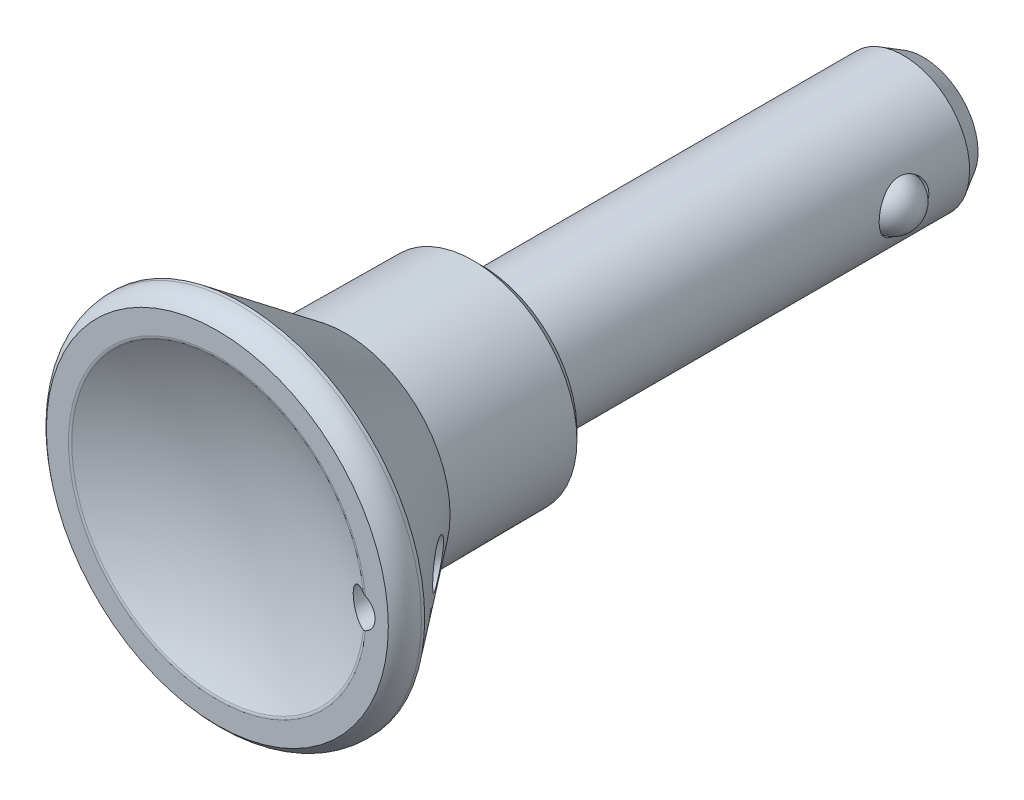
ISO-10303-21;
HEADER;
FILE_DESCRIPTION(('STEP AP214'),'2;1');
FILE_NAME('part.step','',(''),(''),'','','');
FILE_SCHEMA(('AUTOMOTIVE_DESIGN { 1 0 10303 214 1 1 1 1 }'));
ENDSEC;
DATA;
#1=APPLICATION_CONTEXT('core data for automotive mechanical design processes');
#2=APPLICATION_PROTOCOL_DEFINITION('international standard','automotive_design',2000,#1);
#3=PRODUCT_CONTEXT('',#1,'mechanical');
#4=PRODUCT('Part','Part','',(#3));
#5=PRODUCT_RELATED_PRODUCT_CATEGORY('part','',(#4));
#6=PRODUCT_DEFINITION_FORMATION('','',#4);
#7=PRODUCT_DEFINITION_CONTEXT('part definition',#1,'design');
#8=PRODUCT_DEFINITION('design','',#6,#7);
#9=PRODUCT_DEFINITION_SHAPE('','',#8);
#10=(LENGTH_UNIT() NAMED_UNIT(*) SI_UNIT(.MILLI.,.METRE.));
#11=(NAMED_UNIT(*) PLANE_ANGLE_UNIT() SI_UNIT($,.RADIAN.));
#12=(NAMED_UNIT(*) SI_UNIT($,.STERADIAN.) SOLID_ANGLE_UNIT());
#13=UNCERTAINTY_MEASURE_WITH_UNIT(LENGTH_MEASURE(1.E-05),#10,'distance_accuracy_value','');
#14=(GEOMETRIC_REPRESENTATION_CONTEXT(3) GLOBAL_UNCERTAINTY_ASSIGNED_CONTEXT((#13)) GLOBAL_UNIT_ASSIGNED_CONTEXT((#10,
#11,#12)) REPRESENTATION_CONTEXT('',''));
#15=CARTESIAN_POINT('',(0.,0.,0.));
#16=DIRECTION('',(0.,0.,1.));
#17=DIRECTION('',(1.,0.,0.));
#18=AXIS2_PLACEMENT_3D('',#15,#16,#17);
#19=CARTESIAN_POINT('',(0.,0.,23.5));
#20=DIRECTION('',(0.,0.,1.));
#21=DIRECTION('',(0.,-1.,0.));
#22=AXIS2_PLACEMENT_3D('',#19,#20,#21);
#23=TOROIDAL_SURFACE('',#22,13.499629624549,0.50000000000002);
#24=CARTESIAN_POINT('',(13.1832697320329,1.45020836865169,23.940350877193));
#25=CARTESIAN_POINT('',(13.1967898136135,1.44663630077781,23.9473693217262));
#26=CARTESIAN_POINT('',(13.2105528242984,1.44279517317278,23.9537540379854));
#27=CARTESIAN_POINT('',(13.2384329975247,1.43456873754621,23.9652617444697));
#28=CARTESIAN_POINT('',(13.2525500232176,1.43018363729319,23.9703852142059));
#29=CARTESIAN_POINT('',(13.294658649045,1.41639274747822,23.9836925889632));
#30=CARTESIAN_POINT('',(13.322980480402,1.40620303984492,23.9901034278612));
#31=CARTESIAN_POINT('',(13.3645007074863,1.38980064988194,23.9961744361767));
#32=CARTESIAN_POINT('',(13.377775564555,1.38433480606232,23.9976116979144));
#33=CARTESIAN_POINT('',(13.4043485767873,1.37294329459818,23.9995283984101));
#34=CARTESIAN_POINT('',(13.4176457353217,1.3670137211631,23.999998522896));
#35=CARTESIAN_POINT('',(13.430859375,1.3608881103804,24.));
#36=B_SPLINE_CURVE_WITH_KNOTS('',3,(#24,#25,#26,#27,#28,#29,#30,#31,#32,#33,#34,#35),
.UNSPECIFIED.,.F.,.F.,(4,2,2,2,2,4),(0.,0.046898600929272,0.0937793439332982,0.185591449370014,
0.228845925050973,0.272515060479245),.UNSPECIFIED.);
#37=CARTESIAN_POINT('',(13.1832697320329,1.45020836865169,23.940350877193));
#38=VERTEX_POINT('',#37);
#39=CARTESIAN_POINT('',(13.430859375,1.36088811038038,24.));
#40=VERTEX_POINT('',#39);
#41=EDGE_CURVE('E60',#38,#40,#36,.T.);
#42=ORIENTED_EDGE('',*,*,#41,.T.);
#43=CARTESIAN_POINT('',(0.,0.,24.));
#44=DIRECTION('',(0.,0.,1.));
#45=DIRECTION('',(0.,-1.,0.));
#46=AXIS2_PLACEMENT_3D('',#43,#44,#45);
#47=CIRCLE('',#46,13.499629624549);
#48=CARTESIAN_POINT('',(13.430859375,-1.36088811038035,24.));
#49=VERTEX_POINT('',#48);
#50=EDGE_CURVE('E39',#49,#40,#47,.F.);
#51=ORIENTED_EDGE('',*,*,#50,.F.);
#52=CARTESIAN_POINT('',(13.430859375,-1.36088811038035,24.));
#53=CARTESIAN_POINT('',(13.4166665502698,-1.36746807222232,23.9999984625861));
#54=CARTESIAN_POINT('',(13.4023759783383,-1.37382175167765,23.9994558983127));
#55=CARTESIAN_POINT('',(13.3736641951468,-1.38605678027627,23.9972288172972));
#56=CARTESIAN_POINT('',(13.3592428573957,-1.39193760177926,23.9955430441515));
#57=CARTESIAN_POINT('',(13.316571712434,-1.4085689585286,23.9887845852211));
#58=CARTESIAN_POINT('',(13.2882736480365,-1.41860415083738,23.9820148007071));
#59=CARTESIAN_POINT('',(13.2473798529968,-1.43179699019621,23.9685266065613));
#60=CARTESIAN_POINT('',(13.2344037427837,-1.43578270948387,23.9636790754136));
#61=CARTESIAN_POINT('',(13.2086362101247,-1.44332889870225,23.9528611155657));
#62=CARTESIAN_POINT('',(13.1958479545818,-1.44688469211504,23.9468798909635));
#63=CARTESIAN_POINT('',(13.1832697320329,-1.45020836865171,23.940350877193));
#64=B_SPLINE_CURVE_WITH_KNOTS('',3,(#52,#53,#54,#55,#56,#57,#58,#59,#60,#61,#62,#63),
.UNSPECIFIED.,.F.,.F.,(4,2,2,2,2,4),(0.,0.0469051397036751,0.0938619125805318,0.185680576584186,
0.228880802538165,0.272515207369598),.UNSPECIFIED.);
#65=CARTESIAN_POINT('',(13.1832697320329,-1.4502083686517,23.940350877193));
#66=VERTEX_POINT('',#65);
#67=EDGE_CURVE('E20',#49,#66,#64,.T.);
#68=ORIENTED_EDGE('',*,*,#67,.T.);
#69=CARTESIAN_POINT('',(0.,0.,23.940350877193));
#70=DIRECTION('',(0.,0.,1.));
#71=DIRECTION('',(0.,-1.,0.));
#72=AXIS2_PLACEMENT_3D('',#69,#70,#71);
#73=CIRCLE('',#72,13.2627940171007);
#74=EDGE_CURVE('E54',#38,#66,#73,.T.);
#75=ORIENTED_EDGE('',*,*,#74,.F.);
#76=EDGE_LOOP('',(#42,#51,#68,#75));
#77=FACE_BOUND('',#76,.T.);
#78=ADVANCED_FACE('F15',(#77),#23,.T.);
#79=CARTESIAN_POINT('',(0.,0.,48.6));
#80=DIRECTION('',(0.,-1.,0.));
#81=DIRECTION('',(0.,0.,1.));
#82=AXIS2_PLACEMENT_3D('',#79,#80,#81);
#83=SPHERICAL_SURFACE('',#82,28.);
#84=CARTESIAN_POINT('',(13.1832697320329,1.45020836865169,23.940350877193));
#85=CARTESIAN_POINT('',(13.0915993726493,1.4744532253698,23.8927620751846));
#86=CARTESIAN_POINT('',(12.9980560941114,1.489860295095,23.8443501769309));
#87=CARTESIAN_POINT('',(12.8097591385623,1.50293318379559,23.7471842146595));
#88=CARTESIAN_POINT('',(12.7150040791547,1.50057651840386,23.6984297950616));
#89=CARTESIAN_POINT('',(12.5270201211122,1.47798913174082,23.6019874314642));
#90=CARTESIAN_POINT('',(12.4337919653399,1.45774995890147,23.5543000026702));
#91=CARTESIAN_POINT('',(12.2517517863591,1.39948117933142,23.4614379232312));
#92=CARTESIAN_POINT('',(12.1629377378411,1.36145981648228,23.416262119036));
#93=CARTESIAN_POINT('',(11.9952411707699,1.26934990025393,23.3311736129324));
#94=CARTESIAN_POINT('',(11.9161458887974,1.21575714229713,23.2911465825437));
#95=CARTESIAN_POINT('',(11.7681643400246,1.09295087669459,23.2164149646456));
#96=CARTESIAN_POINT('',(11.6992729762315,1.02374521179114,23.1817077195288));
#97=CARTESIAN_POINT('',(11.5811025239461,0.878735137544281,23.1222729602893));
#98=CARTESIAN_POINT('',(11.5305709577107,0.804216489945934,23.0969048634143));
#99=CARTESIAN_POINT('',(11.4431131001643,0.645771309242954,23.0530473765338));
#100=CARTESIAN_POINT('',(11.4061726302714,0.561854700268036,23.0345508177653));
#101=CARTESIAN_POINT('',(11.3518094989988,0.398913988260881,23.0073479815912));
#102=CARTESIAN_POINT('',(11.332464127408,0.320688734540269,22.9976766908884));
#103=CARTESIAN_POINT('',(11.3065630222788,0.161638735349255,22.9847305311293));
#104=CARTESIAN_POINT('',(11.3000015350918,0.0808151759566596,22.9814527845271));
#105=CARTESIAN_POINT('',(11.2999985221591,-0.0778011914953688,22.9814513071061));
#106=CARTESIAN_POINT('',(11.3060768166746,-0.155594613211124,22.9844877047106));
#107=CARTESIAN_POINT('',(11.3300927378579,-0.308850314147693,22.9964912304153));
#108=CARTESIAN_POINT('',(11.3480306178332,-0.384312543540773,23.0054584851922));
#109=CARTESIAN_POINT('',(11.3948947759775,-0.530632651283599,23.0289063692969));
#110=CARTESIAN_POINT('',(11.4237977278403,-0.601499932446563,23.0433752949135));
#111=CARTESIAN_POINT('',(11.4913996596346,-0.737094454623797,23.0772561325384));
#112=CARTESIAN_POINT('',(11.5301003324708,-0.801820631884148,23.0966688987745));
#113=CARTESIAN_POINT('',(11.6176766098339,-0.926360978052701,23.1406602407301));
#114=CARTESIAN_POINT('',(11.6669073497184,-0.98586052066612,23.1654195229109));
#115=CARTESIAN_POINT('',(11.7728262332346,-1.09578522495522,23.2187793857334));
#116=CARTESIAN_POINT('',(11.8295165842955,-1.14620769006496,23.2473811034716));
#117=CARTESIAN_POINT('',(11.9547131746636,-1.24189507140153,23.3106654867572));
#118=CARTESIAN_POINT('',(12.0238340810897,-1.28614058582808,23.3456702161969));
#119=CARTESIAN_POINT('',(12.1672246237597,-1.36242212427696,23.4184517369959));
#120=CARTESIAN_POINT('',(12.2414976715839,-1.39444996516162,23.4562303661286));
#121=CARTESIAN_POINT('',(12.3592920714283,-1.4344825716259,23.5162885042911));
#122=CARTESIAN_POINT('',(12.4017101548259,-1.44682505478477,23.5379430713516));
#123=CARTESIAN_POINT('',(12.4872184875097,-1.46768648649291,23.5816530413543));
#124=CARTESIAN_POINT('',(12.5303081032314,-1.47620883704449,23.603708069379));
#125=CARTESIAN_POINT('',(12.6602504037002,-1.49604024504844,23.6703078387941));
#126=CARTESIAN_POINT('',(12.7478240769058,-1.50162964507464,23.7153114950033));
#127=CARTESIAN_POINT('',(12.8938293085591,-1.49821627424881,23.7905484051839));
#128=CARTESIAN_POINT('',(12.9524047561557,-1.49339577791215,23.8207882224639));
#129=CARTESIAN_POINT('',(13.0686394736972,-1.47691090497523,23.8809033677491));
#130=CARTESIAN_POINT('',(13.1263001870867,-1.46525870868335,23.9107792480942));
#131=CARTESIAN_POINT('',(13.1832697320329,-1.4502083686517,23.9403508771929));
#132=B_SPLINE_CURVE_WITH_KNOTS('',3,(#84,#85,#86,#87,#88,#89,#90,#91,#92,#93,#94,#95,#96,#97,
#98,#99,#100,#101,#102,#103,#104,#105,#106,#107,#108,#109,#110,#111,#112,#113,#114,#115,#116,
#117,#118,#119,#120,#121,#122,#123,#124,#125,#126,#127,#128,#129,#130,#131),.UNSPECIFIED.,.F.,
.F.,(4,2,2,2,2,2,2,2,2,2,2,2,2,2,2,2,2,2,2,2,2,2,2,4),(0.,0.317865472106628,0.636133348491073,
0.954551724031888,1.27282262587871,1.58190076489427,1.89082399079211,2.16986616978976,
2.44861641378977,2.69085568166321,2.93298589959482,3.16608592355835,3.39919092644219,
3.63180279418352,3.8644548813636,4.10674626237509,4.34910950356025,4.61569988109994,
4.88246850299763,5.02992533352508,5.17725058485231,5.4717357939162,5.66970066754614,
5.86731365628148),.UNSPECIFIED.);
#133=EDGE_CURVE('E50',#38,#66,#132,.T.);
#134=ORIENTED_EDGE('',*,*,#133,.F.);
#135=ORIENTED_EDGE('',*,*,#74,.T.);
#136=EDGE_LOOP('',(#134,#135));
#137=FACE_BOUND('',#136,.T.);
#138=ADVANCED_FACE('F52',(#137),#83,.F.);
#139=CARTESIAN_POINT('',(-15.81,-15.5,24.));
#140=CARTESIAN_POINT('',(-15.5,-15.5,24.));
#141=CARTESIAN_POINT('',(15.5,-15.5,24.));
#142=B_SPLINE_CURVE_WITH_KNOTS('',1,(#139,#140,#141),.UNSPECIFIED.,.F.,.F.,(2,1,2),(-0.01,0.,
1.),.UNSPECIFIED.);
#143=DIRECTION('',(0.,1.,0.));
#144=VECTOR('',#143,1.);
#145=SURFACE_OF_LINEAR_EXTRUSION('',#142,#144);
#146=CARTESIAN_POINT('',(12.8,0.,24.));
#147=DIRECTION('',(0.,0.,1.));
#148=DIRECTION('',(0.,-1.,0.));
#149=AXIS2_PLACEMENT_3D('',#146,#147,#148);
#150=CIRCLE('',#149,1.5);
#151=EDGE_CURVE('E57',#49,#40,#150,.T.);
#152=ORIENTED_EDGE('',*,*,#151,.F.);
#153=ORIENTED_EDGE('',*,*,#50,.T.);
#154=EDGE_LOOP('',(#152,#153));
#155=FACE_BOUND('',#154,.T.);
#156=CARTESIAN_POINT('',(0.,0.,24.));
#157=DIRECTION('',(0.,0.,1.));
#158=DIRECTION('',(0.,-1.,0.));
#159=AXIS2_PLACEMENT_3D('',#156,#157,#158);
#160=CIRCLE('',#159,15.5);
#161=CARTESIAN_POINT('',(0.,-15.5,24.));
#162=VERTEX_POINT('',#161);
#163=EDGE_CURVE('E58',#162,#162,#160,.F.);
#164=ORIENTED_EDGE('',*,*,#163,.F.);
#165=EDGE_LOOP('',(#164));
#166=FACE_BOUND('',#165,.T.);
#167=ADVANCED_FACE('F156',(#155,#166),#145,.T.);
#168=CARTESIAN_POINT('',(0.,0.,22.));
#169=DIRECTION('',(0.,0.,1.));
#170=DIRECTION('',(0.,-1.,0.));
#171=AXIS2_PLACEMENT_3D('',#168,#169,#170);
#172=TOROIDAL_SURFACE('',#171,14.,2.5);
#173=ORIENTED_EDGE('',*,*,#163,.T.);
#174=EDGE_LOOP('',(#173));
#175=FACE_BOUND('',#174,.T.);
#176=CARTESIAN_POINT('',(0.,0.,22.));
#177=DIRECTION('',(0.,0.,1.));
#178=DIRECTION('',(1.,0.,0.));
#179=AXIS2_PLACEMENT_3D('',#176,#177,#178);
#180=CIRCLE('',#179,16.5);
#181=CARTESIAN_POINT('',(16.5,0.,22.));
#182=VERTEX_POINT('',#181);
#183=EDGE_CURVE('E101',#182,#182,#180,.F.);
#184=ORIENTED_EDGE('',*,*,#183,.F.);
#185=EDGE_LOOP('',(#184));
#186=FACE_BOUND('',#185,.T.);
#187=ADVANCED_FACE('F79',(#175,#186),#172,.T.);
#188=CARTESIAN_POINT('',(12.8,0.,14.7910576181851));
#189=DIRECTION('',(0.,0.,1.));
#190=DIRECTION('',(0.,-1.,0.));
#191=AXIS2_PLACEMENT_3D('',#188,#189,#190);
#192=CYLINDRICAL_SURFACE('',#191,1.5);
#193=CARTESIAN_POINT('',(12.62421875,-1.48966471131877,16.6671130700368));
#194=CARTESIAN_POINT('',(12.6920032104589,-1.49766166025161,16.7577945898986));
#195=CARTESIAN_POINT('',(12.7603283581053,-1.50104579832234,16.8484671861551));
#196=CARTESIAN_POINT('',(12.897645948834,-1.49839397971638,17.0292601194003));
#197=CARTESIAN_POINT('',(12.9666387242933,-1.49235306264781,17.1193801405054));
#198=CARTESIAN_POINT('',(13.1046564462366,-1.47039580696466,17.2982798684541));
#199=CARTESIAN_POINT('',(13.1736813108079,-1.45448817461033,17.3870606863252));
#200=CARTESIAN_POINT('',(13.3110827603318,-1.41207641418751,17.5624849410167));
#201=CARTESIAN_POINT('',(13.3794598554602,-1.38558148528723,17.6491301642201));
#202=CARTESIAN_POINT('',(13.5187485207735,-1.31898430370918,17.8243946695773));
#203=CARTESIAN_POINT('',(13.5895656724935,-1.27816038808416,17.9128199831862));
#204=CARTESIAN_POINT('',(13.7277317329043,-1.18169522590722,18.084148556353));
#205=CARTESIAN_POINT('',(13.7950853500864,-1.12607476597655,18.1670593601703));
#206=CARTESIAN_POINT('',(13.9084086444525,-1.01303116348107,18.3057043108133));
#207=CARTESIAN_POINT('',(13.9556726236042,-0.959133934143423,18.3632332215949));
#208=CARTESIAN_POINT('',(14.0446143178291,-0.840483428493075,18.471045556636));
#209=CARTESIAN_POINT('',(14.0863013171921,-0.77574860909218,18.5213410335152));
#210=CARTESIAN_POINT('',(14.1507925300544,-0.654717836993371,18.5988956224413));
#211=CARTESIAN_POINT('',(14.1756178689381,-0.601120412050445,18.6286642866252));
#212=CARTESIAN_POINT('',(14.2195452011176,-0.488403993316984,18.6812412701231));
#213=CARTESIAN_POINT('',(14.238652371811,-0.429290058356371,18.7040558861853));
#214=CARTESIAN_POINT('',(14.2689681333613,-0.309460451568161,18.7402118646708));
#215=CARTESIAN_POINT('',(14.2805052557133,-0.248950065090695,18.7539474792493));
#216=CARTESIAN_POINT('',(14.2960184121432,-0.12562551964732,18.77240966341));
#217=CARTESIAN_POINT('',(14.3000000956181,-0.0628131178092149,18.7771429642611));
#218=CARTESIAN_POINT('',(14.2999999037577,0.0632231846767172,18.7771427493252));
#219=CARTESIAN_POINT('',(14.2959658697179,0.126447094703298,18.7723472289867));
#220=CARTESIAN_POINT('',(14.2802519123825,0.250551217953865,18.7536458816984));
#221=CARTESIAN_POINT('',(14.2685662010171,0.311429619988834,18.7397331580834));
#222=CARTESIAN_POINT('',(14.2387365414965,0.428564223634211,18.7041556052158));
#223=CARTESIAN_POINT('',(14.2206451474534,0.484853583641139,18.6825538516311));
#224=CARTESIAN_POINT('',(14.1792492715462,0.592453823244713,18.633014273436));
#225=CARTESIAN_POINT('',(14.1559422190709,0.643762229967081,18.6050733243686));
#226=CARTESIAN_POINT('',(14.0931329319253,0.764461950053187,18.5295741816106));
#227=CARTESIAN_POINT('',(14.0512237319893,0.830727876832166,18.4790335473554));
#228=CARTESIAN_POINT('',(13.9615408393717,0.952125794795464,18.370367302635));
#229=CARTESIAN_POINT('',(13.9137529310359,1.00722990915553,18.3122232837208));
#230=CARTESIAN_POINT('',(13.7883270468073,1.13348006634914,18.1588182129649));
#231=CARTESIAN_POINT('',(13.708179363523,1.1978805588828,18.0600849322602));
#232=CARTESIAN_POINT('',(13.5435609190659,1.3064664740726,17.8554996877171));
#233=CARTESIAN_POINT('',(13.4590828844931,1.35061655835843,17.7496356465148));
#234=CARTESIAN_POINT('',(13.3107013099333,1.41202717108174,17.5619635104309));
#235=CARTESIAN_POINT('',(13.2471965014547,1.43330058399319,17.4811068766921));
#236=CARTESIAN_POINT('',(13.1198264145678,1.46698834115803,17.3177942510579));
#237=CARTESIAN_POINT('',(13.0559609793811,1.47939847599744,17.2353375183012));
#238=CARTESIAN_POINT('',(12.9282718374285,1.49589397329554,17.0692879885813));
#239=CARTESIAN_POINT('',(12.8644485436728,1.49996064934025,16.9856930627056));
#240=CARTESIAN_POINT('',(12.7374091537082,1.5000387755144,16.8180712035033));
#241=CARTESIAN_POINT('',(12.6741929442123,1.49605175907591,16.7340443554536));
#242=CARTESIAN_POINT('',(12.5469978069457,1.47993658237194,16.5637117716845));
#243=CARTESIAN_POINT('',(12.4830456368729,1.46758777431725,16.4774068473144));
#244=CARTESIAN_POINT('',(12.3565302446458,1.43443826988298,16.3053467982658));
#245=CARTESIAN_POINT('',(12.2939675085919,1.41363466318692,16.2195918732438));
#246=CARTESIAN_POINT('',(12.1709555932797,1.36334219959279,16.0496685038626));
#247=CARTESIAN_POINT('',(12.1104987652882,1.33388949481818,15.9654949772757));
#248=CARTESIAN_POINT('',(11.9920388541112,1.26565016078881,15.7992974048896));
#249=CARTESIAN_POINT('',(11.9340336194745,1.2268719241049,15.7172714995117));
#250=CARTESIAN_POINT('',(11.8266654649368,1.14315320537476,15.5643050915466));
#251=CARTESIAN_POINT('',(11.7770073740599,1.09916121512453,15.4930561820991));
#252=CARTESIAN_POINT('',(11.6811267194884,1.0014126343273,15.3545942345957));
#253=CARTESIAN_POINT('',(11.6349116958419,0.947635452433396,15.2873901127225));
#254=CARTESIAN_POINT('',(11.5691423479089,0.858125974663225,15.1911821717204));
#255=CARTESIAN_POINT('',(11.5476572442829,0.826531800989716,15.1596504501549));
#256=CARTESIAN_POINT('',(11.5063433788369,0.760253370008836,15.0988444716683));
#257=CARTESIAN_POINT('',(11.4865152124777,0.725568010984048,15.0695710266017));
#258=CARTESIAN_POINT('',(11.4302732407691,0.616814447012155,14.9863165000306));
#259=CARTESIAN_POINT('',(11.3967954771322,0.537651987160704,14.9364517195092));
#260=CARTESIAN_POINT('',(11.3555291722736,0.407099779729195,14.8747804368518));
#261=CARTESIAN_POINT('',(11.3430899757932,0.360365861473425,14.856144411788));
#262=CARTESIAN_POINT('',(11.3225831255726,0.263914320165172,14.8253840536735));
#263=CARTESIAN_POINT('',(11.3145046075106,0.214204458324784,14.8132435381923));
#264=CARTESIAN_POINT('',(11.3059949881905,0.136701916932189,14.8004485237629));
#265=CARTESIAN_POINT('',(11.3037543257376,0.109528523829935,14.7970776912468));
#266=CARTESIAN_POINT('',(11.300755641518,0.0549082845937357,14.7925658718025));
#267=CARTESIAN_POINT('',(11.2999979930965,0.0274613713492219,14.791425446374));
#268=CARTESIAN_POINT('',(11.3000036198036,-0.0495314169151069,14.7914342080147));
#269=CARTESIAN_POINT('',(11.3024785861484,-0.0991098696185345,14.7951600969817));
#270=CARTESIAN_POINT('',(11.3121472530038,-0.196763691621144,14.8096998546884));
#271=CARTESIAN_POINT('',(11.3193489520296,-0.24483636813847,14.8205257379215));
#272=CARTESIAN_POINT('',(11.3399096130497,-0.348584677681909,14.8513795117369));
#273=CARTESIAN_POINT('',(11.3542736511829,-0.403610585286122,14.872906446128));
#274=CARTESIAN_POINT('',(11.387815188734,-0.508718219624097,14.9230284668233));
#275=CARTESIAN_POINT('',(11.4070004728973,-0.558791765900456,14.9516349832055));
#276=CARTESIAN_POINT('',(11.4595328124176,-0.677671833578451,15.0296959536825));
#277=CARTESIAN_POINT('',(11.4951602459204,-0.743300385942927,15.0824162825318));
#278=CARTESIAN_POINT('',(11.5718624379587,-0.864190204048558,15.1952386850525));
#279=CARTESIAN_POINT('',(11.6129512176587,-0.919423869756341,15.2553597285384));
#280=CARTESIAN_POINT('',(11.6921657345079,-1.01283475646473,15.3705343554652));
#281=CARTESIAN_POINT('',(11.7297508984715,-1.05232856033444,15.4249113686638));
#282=CARTESIAN_POINT('',(11.8070065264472,-1.12552131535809,15.5360737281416));
#283=CARTESIAN_POINT('',(11.8466784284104,-1.15921620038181,15.5928607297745));
#284=CARTESIAN_POINT('',(11.9276586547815,-1.22132048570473,15.7081342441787));
#285=CARTESIAN_POINT('',(11.9689673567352,-1.24972865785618,15.7666211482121));
#286=CARTESIAN_POINT('',(12.0529136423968,-1.30165144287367,15.884812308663));
#287=CARTESIAN_POINT('',(12.0955516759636,-1.32516437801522,15.9445169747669));
#288=CARTESIAN_POINT('',(12.2167649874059,-1.38470455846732,16.1132939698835));
#289=CARTESIAN_POINT('',(12.2965837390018,-1.41552588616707,16.2233378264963));
#290=CARTESIAN_POINT('',(12.458735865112,-1.46310486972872,16.4446295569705));
#291=CARTESIAN_POINT('',(12.5410705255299,-1.47985520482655,16.5558780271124));
#292=CARTESIAN_POINT('',(12.62421875,-1.48966471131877,16.6671130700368));
#293=B_SPLINE_CURVE_WITH_KNOTS('',3,(#193,#194,#195,#196,#197,#198,#199,#200,#201,#202,#203,
#204,#205,#206,#207,#208,#209,#210,#211,#212,#213,#214,#215,#216,#217,#218,#219,#220,#221,#222,
#223,#224,#225,#226,#227,#228,#229,#230,#231,#232,#233,#234,#235,#236,#237,#238,#239,#240,#241,
#242,#243,#244,#245,#246,#247,#248,#249,#250,#251,#252,#253,#254,#255,#256,#257,#258,#259,#260,
#261,#262,#263,#264,#265,#266,#267,#268,#269,#270,#271,#272,#273,#274,#275,#276,#277,#278,#279,
#280,#281,#282,#283,#284,#285,#286,#287,#288,#289,#290,#291,#292),.UNSPECIFIED.,.T.,.F.,(4,2,2,
2,2,2,2,2,2,2,2,2,2,2,2,2,2,2,2,2,2,2,2,2,2,2,2,2,2,2,2,2,2,2,2,2,2,2,2,2,2,2,2,2,2,2,2,2,2,4),
(0.,0.3403810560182,0.680941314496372,1.02120149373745,1.36116666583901,1.72154948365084,
2.08142867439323,2.35634247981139,2.63079277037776,2.82853330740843,3.02609425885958,
3.21438583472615,3.40253656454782,3.59191561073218,3.78143807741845,3.96944036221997,
4.15753551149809,4.43581804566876,4.71478725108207,5.14007838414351,5.56610888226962,
5.88069336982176,6.19542716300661,6.51086508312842,6.82624294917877,7.15028500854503,
7.47443870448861,7.79725631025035,8.11978447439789,8.41136093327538,8.70355821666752,
8.8520054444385,9.00050579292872,9.29551066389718,9.45047012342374,9.60504170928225,
9.6873437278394,9.76966646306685,9.91815000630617,10.0668854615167,10.2482950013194,
10.4299993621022,10.7027068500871,10.9761285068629,11.2068168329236,11.4376662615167,
11.6685692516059,11.8995512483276,12.3168647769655,12.7343952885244),.UNSPECIFIED.);
#294=CARTESIAN_POINT('',(12.62421875,-1.48966471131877,16.6671130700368));
#295=VERTEX_POINT('',#294);
#296=EDGE_CURVE('E93',#295,#295,#293,.T.);
#297=ORIENTED_EDGE('',*,*,#296,.F.);
#298=EDGE_LOOP('',(#297));
#299=FACE_BOUND('',#298,.T.);
#300=ORIENTED_EDGE('',*,*,#67,.F.);
#301=ORIENTED_EDGE('',*,*,#151,.T.);
#302=ORIENTED_EDGE('',*,*,#41,.F.);
#303=ORIENTED_EDGE('',*,*,#133,.T.);
#304=EDGE_LOOP('',(#300,#301,#302,#303));
#305=FACE_BOUND('',#304,.T.);
#306=ADVANCED_FACE('F61',(#299,#305),#192,.F.);
#307=CARTESIAN_POINT('',(0.,0.,22.));
#308=DIRECTION('',(0.,0.,1.));
#309=DIRECTION('',(0.,-1.,0.));
#310=AXIS2_PLACEMENT_3D('',#307,#308,#309);
#311=CYLINDRICAL_SURFACE('',#310,16.5);
#312=ORIENTED_EDGE('',*,*,#183,.T.);
#313=EDGE_LOOP('',(#312));
#314=FACE_BOUND('',#313,.T.);
#315=CARTESIAN_POINT('',(0.,0.,21.7));
#316=DIRECTION('',(0.,0.,-1.));
#317=DIRECTION('',(1.,0.,0.));
#318=AXIS2_PLACEMENT_3D('',#315,#316,#317);
#319=CIRCLE('',#318,16.5);
#320=CARTESIAN_POINT('',(16.5,0.,21.7));
#321=VERTEX_POINT('',#320);
#322=EDGE_CURVE('E100',#321,#321,#319,.T.);
#323=ORIENTED_EDGE('',*,*,#322,.F.);
#324=EDGE_LOOP('',(#323));
#325=FACE_BOUND('',#324,.T.);
#326=ADVANCED_FACE('F78',(#314,#325),#311,.T.);
#327=CARTESIAN_POINT('',(0.,0.,12.4));
#328=DIRECTION('',(0.,0.,1.));
#329=DIRECTION('',(0.,-1.,0.));
#330=AXIS2_PLACEMENT_3D('',#327,#328,#329);
#331=CONICAL_SURFACE('',#330,9.5,0.645219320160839);
#332=ORIENTED_EDGE('',*,*,#296,.T.);
#333=EDGE_LOOP('',(#332));
#334=FACE_BOUND('',#333,.T.);
#335=ORIENTED_EDGE('',*,*,#322,.T.);
#336=EDGE_LOOP('',(#335));
#337=FACE_BOUND('',#336,.T.);
#338=CARTESIAN_POINT('',(0.,0.,12.4));
#339=DIRECTION('',(0.,0.,-1.));
#340=DIRECTION('',(1.,0.,0.));
#341=AXIS2_PLACEMENT_3D('',#338,#339,#340);
#342=CIRCLE('',#341,9.5);
#343=CARTESIAN_POINT('',(9.5,0.,12.4));
#344=VERTEX_POINT('',#343);
#345=EDGE_CURVE('E137',#344,#344,#342,.T.);
#346=ORIENTED_EDGE('',*,*,#345,.F.);
#347=EDGE_LOOP('',(#346));
#348=FACE_BOUND('',#347,.T.);
#349=ADVANCED_FACE('F104',(#334,#337,#348),#331,.T.);
#350=CARTESIAN_POINT('',(0.,0.,0.799969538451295));
#351=DIRECTION('',(0.,0.,1.));
#352=DIRECTION('',(0.,-1.,0.));
#353=AXIS2_PLACEMENT_3D('',#350,#351,#352);
#354=CONICAL_SURFACE('',#353,9.39876806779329,0.00872664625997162);
#355=ORIENTED_EDGE('',*,*,#345,.T.);
#356=EDGE_LOOP('',(#355));
#357=FACE_BOUND('',#356,.T.);
#358=CARTESIAN_POINT('',(0.,0.,0.799969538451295));
#359=DIRECTION('',(0.,0.,-1.));
#360=DIRECTION('',(1.,0.,0.));
#361=AXIS2_PLACEMENT_3D('',#358,#359,#360);
#362=CIRCLE('',#361,9.39876806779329);
#363=CARTESIAN_POINT('',(9.39876806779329,0.,0.799969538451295));
#364=VERTEX_POINT('',#363);
#365=EDGE_CURVE('E133',#364,#364,#362,.T.);
#366=ORIENTED_EDGE('',*,*,#365,.F.);
#367=EDGE_LOOP('',(#366));
#368=FACE_BOUND('',#367,.T.);
#369=ADVANCED_FACE('F108',(#357,#368),#354,.T.);
#370=CARTESIAN_POINT('',(4.96076951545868,-5.02030085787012,-40.));
#371=DIRECTION('',(0.,0.,-1.));
#372=DIRECTION('',(-1.,0.,0.));
#373=AXIS2_PLACEMENT_3D('',#370,#371,#372);
#374=PLANE('',#373);
#375=CARTESIAN_POINT('',(0.,0.,-40.));
#376=DIRECTION('',(0.,0.,1.));
#377=DIRECTION('',(0.,-1.,0.));
#378=AXIS2_PLACEMENT_3D('',#375,#376,#377);
#379=CIRCLE('',#378,4.96076951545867);
#380=CARTESIAN_POINT('',(0.,-4.96076951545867,-40.));
#381=VERTEX_POINT('',#380);
#382=EDGE_CURVE('E102',#381,#381,#379,.T.);
#383=ORIENTED_EDGE('',*,*,#382,.F.);
#384=EDGE_LOOP('',(#383));
#385=FACE_BOUND('',#384,.T.);
#386=ADVANCED_FACE('F112',(#385),#374,.T.);
#387=CARTESIAN_POINT('',(0.,0.,0.));
#388=DIRECTION('',(0.,0.,1.));
#389=DIRECTION('',(0.,-1.,0.));
#390=AXIS2_PLACEMENT_3D('',#387,#388,#389);
#391=CONICAL_SURFACE('',#390,8.59178683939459,0.789761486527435);
#392=ORIENTED_EDGE('',*,*,#365,.T.);
#393=EDGE_LOOP('',(#392));
#394=FACE_BOUND('',#393,.T.);
#395=CARTESIAN_POINT('',(0.,0.,0.));
#396=DIRECTION('',(0.,0.,1.));
#397=DIRECTION('',(0.,-1.,0.));
#398=AXIS2_PLACEMENT_3D('',#395,#396,#397);
#399=CIRCLE('',#398,8.59178683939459);
#400=CARTESIAN_POINT('',(0.,-8.59178683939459,0.));
#401=VERTEX_POINT('',#400);
#402=EDGE_CURVE('E214',#401,#401,#399,.F.);
#403=ORIENTED_EDGE('',*,*,#402,.F.);
#404=EDGE_LOOP('',(#403));
#405=FACE_BOUND('',#404,.T.);
#406=ADVANCED_FACE('F116',(#394,#405),#391,.T.);
#407=CARTESIAN_POINT('',(4.99,0.,-32.25));
#408=DIRECTION('',(0.,-1.,0.));
#409=DIRECTION('',(0.,0.,-1.));
#410=AXIS2_PLACEMENT_3D('',#407,#408,#409);
#411=SPHERICAL_SURFACE('',#410,2.26);
#412=CARTESIAN_POINT('',(5.20236760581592,0.,-32.25));
#413=DIRECTION('',(1.,0.,0.));
#414=DIRECTION('',(0.,-1.,0.));
#415=AXIS2_PLACEMENT_3D('',#412,#413,#414);
#416=CIRCLE('',#415,2.25);
#417=CARTESIAN_POINT('',(5.20236760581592,-2.25,-32.25));
#418=VERTEX_POINT('',#417);
#419=EDGE_CURVE('E217',#418,#418,#416,.F.);
#420=ORIENTED_EDGE('',*,*,#419,.F.);
#421=EDGE_LOOP('',(#420));
#422=FACE_BOUND('',#421,.T.);
#423=ADVANCED_FACE('F120',(#422),#411,.T.);
#424=CARTESIAN_POINT('',(0.,0.,-40.));
#425=DIRECTION('',(0.,0.,1.));
#426=DIRECTION('',(0.,-1.,0.));
#427=AXIS2_PLACEMENT_3D('',#424,#425,#426);
#428=CONICAL_SURFACE('',#427,4.96076951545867,0.523598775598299);
#429=ORIENTED_EDGE('',*,*,#382,.T.);
#430=EDGE_LOOP('',(#429));
#431=FACE_BOUND('',#430,.T.);
#432=CARTESIAN_POINT('',(0.,0.,-38.2));
#433=DIRECTION('',(0.,0.,1.));
#434=DIRECTION('',(1.,0.,0.));
#435=AXIS2_PLACEMENT_3D('',#432,#433,#434);
#436=CIRCLE('',#435,6.);
#437=CARTESIAN_POINT('',(6.,0.,-38.2));
#438=VERTEX_POINT('',#437);
#439=EDGE_CURVE('E131',#438,#438,#436,.T.);
#440=ORIENTED_EDGE('',*,*,#439,.F.);
#441=EDGE_LOOP('',(#440));
#442=FACE_BOUND('',#441,.T.);
#443=ADVANCED_FACE('F125',(#431,#442),#428,.T.);
#444=CARTESIAN_POINT('',(8.5917868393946,-8.69489038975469,0.));
#445=DIRECTION('',(0.,0.,-1.));
#446=DIRECTION('',(-1.,0.,0.));
#447=AXIS2_PLACEMENT_3D('',#444,#445,#446);
#448=PLANE('',#447);
#449=CARTESIAN_POINT('',(0.,0.,0.));
#450=DIRECTION('',(0.,0.,1.));
#451=DIRECTION('',(0.,-1.,0.));
#452=AXIS2_PLACEMENT_3D('',#449,#450,#451);
#453=CIRCLE('',#452,6.);
#454=CARTESIAN_POINT('',(0.,-6.,0.));
#455=VERTEX_POINT('',#454);
#456=EDGE_CURVE('E196',#455,#455,#453,.F.);
#457=ORIENTED_EDGE('',*,*,#456,.F.);
#458=EDGE_LOOP('',(#457));
#459=FACE_BOUND('',#458,.T.);
#460=ORIENTED_EDGE('',*,*,#402,.T.);
#461=EDGE_LOOP('',(#460));
#462=FACE_BOUND('',#461,.T.);
#463=ADVANCED_FACE('F201',(#459,#462),#448,.T.);
#464=CARTESIAN_POINT('',(5.20236760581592,0.,-32.25));
#465=DIRECTION('',(1.,0.,0.));
#466=DIRECTION('',(0.,-1.,0.));
#467=AXIS2_PLACEMENT_3D('',#464,#465,#466);
#468=CYLINDRICAL_SURFACE('',#467,2.25);
#469=ORIENTED_EDGE('',*,*,#419,.T.);
#470=EDGE_LOOP('',(#469));
#471=FACE_BOUND('',#470,.T.);
#472=CARTESIAN_POINT('',(6.,0.,-30.));
#473=CARTESIAN_POINT('',(5.99999462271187,0.121667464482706,-30.000007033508));
#474=CARTESIAN_POINT('',(5.9962597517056,0.243448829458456,-30.0099159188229));
#475=CARTESIAN_POINT('',(5.98170081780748,0.483504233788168,-30.0491900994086));
#476=CARTESIAN_POINT('',(5.97086593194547,0.601772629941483,-30.0785850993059));
#477=CARTESIAN_POINT('',(5.9432796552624,0.83110384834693,-30.1556365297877));
#478=CARTESIAN_POINT('',(5.92654369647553,0.942184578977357,-30.203245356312));
#479=CARTESIAN_POINT('',(5.88882492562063,1.15473323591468,-30.3151801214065));
#480=CARTESIAN_POINT('',(5.86784233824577,1.25620167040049,-30.3795051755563));
#481=CARTESIAN_POINT('',(5.82279419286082,1.45101685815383,-30.5259171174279));
#482=CARTESIAN_POINT('',(5.79864114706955,1.54390166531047,-30.6085915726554));
#483=CARTESIAN_POINT('',(5.75040444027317,1.71486282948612,-30.7881111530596));
#484=CARTESIAN_POINT('',(5.72632080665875,1.79293396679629,-30.8849612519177));
#485=CARTESIAN_POINT('',(5.67993703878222,1.93497305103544,-31.0945762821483));
#486=CARTESIAN_POINT('',(5.65773970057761,1.99829097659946,-31.2078067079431));
#487=CARTESIAN_POINT('',(5.61899788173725,2.10477976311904,-31.4442726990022));
#488=CARTESIAN_POINT('',(5.60245113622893,2.14795869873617,-31.567504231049));
#489=CARTESIAN_POINT('',(5.5778161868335,2.21112647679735,-31.8151751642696));
#490=CARTESIAN_POINT('',(5.56940885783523,2.2319939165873,-31.9393576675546));
#491=CARTESIAN_POINT('',(5.56107092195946,2.25269334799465,-32.1897243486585));
#492=CARTESIAN_POINT('',(5.56113680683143,2.25253404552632,-32.315907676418));
#493=CARTESIAN_POINT('',(5.56946266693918,2.23185646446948,-32.5586540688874));
#494=CARTESIAN_POINT('',(5.57723200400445,2.21255720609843,-32.6753409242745));
#495=CARTESIAN_POINT('',(5.59927401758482,2.15616264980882,-32.9036803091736));
#496=CARTESIAN_POINT('',(5.61354769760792,2.11906460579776,-33.0153320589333));
#497=CARTESIAN_POINT('',(5.64728592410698,2.0274551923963,-33.2329181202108));
#498=CARTESIAN_POINT('',(5.6668436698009,1.97262730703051,-33.3387040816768));
#499=CARTESIAN_POINT('',(5.70891418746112,1.84733776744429,-33.5399230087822));
#500=CARTESIAN_POINT('',(5.73142784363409,1.77687143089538,-33.6353528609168));
#501=CARTESIAN_POINT('',(5.7787168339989,1.61673979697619,-33.8198908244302));
#502=CARTESIAN_POINT('',(5.80354258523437,1.52610382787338,-33.9081456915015));
#503=CARTESIAN_POINT('',(5.85136882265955,1.33099961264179,-34.0684848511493));
#504=CARTESIAN_POINT('',(5.87436846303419,1.22652501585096,-34.1405616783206));
#505=CARTESIAN_POINT('',(5.9164128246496,1.00450158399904,-34.2674460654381));
#506=CARTESIAN_POINT('',(5.93538783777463,0.886769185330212,-34.3219566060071));
#507=CARTESIAN_POINT('',(5.96670045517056,0.643032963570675,-34.4100294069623));
#508=CARTESIAN_POINT('',(5.97905147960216,0.517046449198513,-34.4436340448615));
#509=CARTESIAN_POINT('',(5.99154588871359,0.32487413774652,-34.4773780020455));
#510=CARTESIAN_POINT('',(5.99470542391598,0.260242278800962,-34.4858488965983));
#511=CARTESIAN_POINT('',(5.99893391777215,0.130417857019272,-34.4971617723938));
#512=CARTESIAN_POINT('',(6.00000288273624,0.0652252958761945,-34.5000037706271));
#513=CARTESIAN_POINT('',(5.99999462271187,-0.121667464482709,-34.499992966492));
#514=CARTESIAN_POINT('',(5.9962597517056,-0.243448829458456,-34.4900840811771));
#515=CARTESIAN_POINT('',(5.98170081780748,-0.483504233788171,-34.4508099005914));
#516=CARTESIAN_POINT('',(5.97086593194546,-0.601772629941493,-34.4214149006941));
#517=CARTESIAN_POINT('',(5.9432796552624,-0.831103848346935,-34.3443634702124));
#518=CARTESIAN_POINT('',(5.92654369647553,-0.942184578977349,-34.296754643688));
#519=CARTESIAN_POINT('',(5.88882492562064,-1.15473323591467,-34.1848198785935));
#520=CARTESIAN_POINT('',(5.86784233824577,-1.25620167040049,-34.1204948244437));
#521=CARTESIAN_POINT('',(5.82279419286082,-1.45101685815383,-33.9740828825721));
#522=CARTESIAN_POINT('',(5.79864114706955,-1.54390166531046,-33.8914084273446));
#523=CARTESIAN_POINT('',(5.75040444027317,-1.71486282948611,-33.7118888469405));
#524=CARTESIAN_POINT('',(5.72632080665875,-1.7929339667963,-33.6150387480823));
#525=CARTESIAN_POINT('',(5.67993703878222,-1.93497305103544,-33.4054237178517));
#526=CARTESIAN_POINT('',(5.65773970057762,-1.99829097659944,-33.2921932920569));
#527=CARTESIAN_POINT('',(5.61899788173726,-2.10477976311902,-33.0557273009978));
#528=CARTESIAN_POINT('',(5.60245113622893,-2.14795869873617,-32.9324957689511));
#529=CARTESIAN_POINT('',(5.5778161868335,-2.21112647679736,-32.6848248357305));
#530=CARTESIAN_POINT('',(5.56940885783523,-2.2319939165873,-32.5606423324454));
#531=CARTESIAN_POINT('',(5.56107092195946,-2.25269334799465,-32.3102756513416));
#532=CARTESIAN_POINT('',(5.56113680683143,-2.25253404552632,-32.184092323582));
#533=CARTESIAN_POINT('',(5.56946266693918,-2.23185646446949,-31.9413459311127));
#534=CARTESIAN_POINT('',(5.57723200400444,-2.21255720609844,-31.8246590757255));
#535=CARTESIAN_POINT('',(5.59927401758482,-2.15616264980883,-31.5963196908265));
#536=CARTESIAN_POINT('',(5.61354769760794,-2.11906460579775,-31.4846679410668));
#537=CARTESIAN_POINT('',(5.64728592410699,-2.0274551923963,-31.2670818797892));
#538=CARTESIAN_POINT('',(5.66684366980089,-1.97262730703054,-31.1612959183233));
#539=CARTESIAN_POINT('',(5.7089141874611,-1.84733776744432,-30.9600769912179));
#540=CARTESIAN_POINT('',(5.73142784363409,-1.77687143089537,-30.8646471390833));
#541=CARTESIAN_POINT('',(5.77871683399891,-1.61673979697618,-30.6801091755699));
#542=CARTESIAN_POINT('',(5.80354258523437,-1.5261038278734,-30.5918543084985));
#543=CARTESIAN_POINT('',(5.85136882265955,-1.33099961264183,-30.4315151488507));
#544=CARTESIAN_POINT('',(5.87436846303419,-1.22652501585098,-30.3594383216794));
#545=CARTESIAN_POINT('',(5.9164128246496,-1.00450158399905,-30.232553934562));
#546=CARTESIAN_POINT('',(5.93538783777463,-0.886769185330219,-30.1780433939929));
#547=CARTESIAN_POINT('',(5.96670045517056,-0.643032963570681,-30.0899705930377));
#548=CARTESIAN_POINT('',(5.97905147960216,-0.517046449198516,-30.0563659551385));
#549=CARTESIAN_POINT('',(5.9915458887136,-0.324874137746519,-30.0226219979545));
#550=CARTESIAN_POINT('',(5.99470542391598,-0.260242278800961,-30.0141511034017));
#551=CARTESIAN_POINT('',(5.99893391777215,-0.130417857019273,-30.0028382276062));
#552=CARTESIAN_POINT('',(6.00000288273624,-0.065225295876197,-29.9999962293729));
#553=CARTESIAN_POINT('',(6.,0.,-30.));
#554=B_SPLINE_CURVE_WITH_KNOTS('',3,(#472,#473,#474,#475,#476,#477,#478,#479,#480,#481,#482,
#483,#484,#485,#486,#487,#488,#489,#490,#491,#492,#493,#494,#495,#496,#497,#498,#499,#500,#501,
#502,#503,#504,#505,#506,#507,#508,#509,#510,#511,#512,#513,#514,#515,#516,#517,#518,#519,#520,
#521,#522,#523,#524,#525,#526,#527,#528,#529,#530,#531,#532,#533,#534,#535,#536,#537,#538,#539,
#540,#541,#542,#543,#544,#545,#546,#547,#548,#549,#550,#551,#552,#553),.UNSPECIFIED.,.T.,.F.,(4,
2,2,2,2,2,2,2,2,2,2,2,2,2,2,2,2,2,2,2,2,2,2,2,2,2,2,2,2,2,2,2,2,2,2,2,2,2,2,2,4),(0.,
0.364749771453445,0.730056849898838,1.09441560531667,1.45875508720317,1.83709555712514,
2.21556909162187,2.60845040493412,3.00117405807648,3.3777882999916,3.75424660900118,
4.10817453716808,4.46215708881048,4.82284441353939,5.18363987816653,5.56863323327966,
5.95380388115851,6.34518169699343,6.73576355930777,6.9313046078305,7.12684506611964,
7.49159483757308,7.85690191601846,8.2212606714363,8.58560015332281,8.96394062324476,
9.34241415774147,9.73529547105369,10.128019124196,10.5046333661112,10.8810916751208,
11.2350196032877,11.5890021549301,11.949689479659,12.3104849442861,12.6954782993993,
13.0806489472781,13.4720267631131,13.8626086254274,14.0581496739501,14.2536901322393),.UNSPECIFIED.);
#555=CARTESIAN_POINT('',(6.,0.,-30.));
#556=VERTEX_POINT('',#555);
#557=EDGE_CURVE('E188',#556,#556,#554,.T.);
#558=ORIENTED_EDGE('',*,*,#557,.F.);
#559=EDGE_LOOP('',(#558));
#560=FACE_BOUND('',#559,.T.);
#561=ADVANCED_FACE('F198',(#471,#560),#468,.F.);
#562=CARTESIAN_POINT('',(-4.99,0.,-32.25));
#563=DIRECTION('',(0.,-1.,0.));
#564=DIRECTION('',(0.,0.,-1.));
#565=AXIS2_PLACEMENT_3D('',#562,#563,#564);
#566=SPHERICAL_SURFACE('',#565,2.26);
#567=CARTESIAN_POINT('',(-5.2023676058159,0.,-32.25));
#568=DIRECTION('',(1.,0.,0.));
#569=DIRECTION('',(0.,-1.,0.));
#570=AXIS2_PLACEMENT_3D('',#567,#568,#569);
#571=CIRCLE('',#570,2.25);
#572=CARTESIAN_POINT('',(-5.2023676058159,-2.25,-32.25));
#573=VERTEX_POINT('',#572);
#574=EDGE_CURVE('E32',#573,#573,#571,.T.);
#575=ORIENTED_EDGE('',*,*,#574,.F.);
#576=EDGE_LOOP('',(#575));
#577=FACE_BOUND('',#576,.T.);
#578=ADVANCED_FACE('F173',(#577),#566,.T.);
#579=CARTESIAN_POINT('',(0.,0.,0.));
#580=DIRECTION('',(0.,0.,1.));
#581=DIRECTION('',(0.,-1.,0.));
#582=AXIS2_PLACEMENT_3D('',#579,#580,#581);
#583=CYLINDRICAL_SURFACE('',#582,6.);
#584=ORIENTED_EDGE('',*,*,#439,.T.);
#585=EDGE_LOOP('',(#584));
#586=FACE_BOUND('',#585,.T.);
#587=CARTESIAN_POINT('',(-6.,0.,-30.));
#588=CARTESIAN_POINT('',(-5.99999462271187,0.121667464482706,-30.000007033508));
#589=CARTESIAN_POINT('',(-5.9962597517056,0.243448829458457,-30.0099159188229));
#590=CARTESIAN_POINT('',(-5.98170081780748,0.483504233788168,-30.0491900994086));
#591=CARTESIAN_POINT('',(-5.97086593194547,0.601772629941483,-30.0785850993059));
#592=CARTESIAN_POINT('',(-5.9432796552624,0.831103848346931,-30.1556365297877));
#593=CARTESIAN_POINT('',(-5.92654369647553,0.942184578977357,-30.203245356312));
#594=CARTESIAN_POINT('',(-5.88882492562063,1.15473323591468,-30.3151801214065));
#595=CARTESIAN_POINT('',(-5.86784233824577,1.25620167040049,-30.3795051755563));
#596=CARTESIAN_POINT('',(-5.82279419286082,1.45101685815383,-30.5259171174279));
#597=CARTESIAN_POINT('',(-5.79864114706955,1.54390166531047,-30.6085915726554));
#598=CARTESIAN_POINT('',(-5.75040444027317,1.71486282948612,-30.7881111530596));
#599=CARTESIAN_POINT('',(-5.72632080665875,1.79293396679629,-30.8849612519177));
#600=CARTESIAN_POINT('',(-5.67993703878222,1.93497305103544,-31.0945762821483));
#601=CARTESIAN_POINT('',(-5.65773970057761,1.99829097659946,-31.2078067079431));
#602=CARTESIAN_POINT('',(-5.61899788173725,2.10477976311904,-31.4442726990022));
#603=CARTESIAN_POINT('',(-5.60245113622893,2.14795869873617,-31.567504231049));
#604=CARTESIAN_POINT('',(-5.5778161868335,2.21112647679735,-31.8151751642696));
#605=CARTESIAN_POINT('',(-5.56940885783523,2.2319939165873,-31.9393576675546));
#606=CARTESIAN_POINT('',(-5.56107092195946,2.25269334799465,-32.1897243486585));
#607=CARTESIAN_POINT('',(-5.56113680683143,2.25253404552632,-32.315907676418));
#608=CARTESIAN_POINT('',(-5.56946266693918,2.23185646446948,-32.5586540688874));
#609=CARTESIAN_POINT('',(-5.57723200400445,2.21255720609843,-32.6753409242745));
#610=CARTESIAN_POINT('',(-5.59927401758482,2.15616264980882,-32.9036803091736));
#611=CARTESIAN_POINT('',(-5.61354769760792,2.11906460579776,-33.0153320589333));
#612=CARTESIAN_POINT('',(-5.64728592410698,2.0274551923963,-33.2329181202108));
#613=CARTESIAN_POINT('',(-5.6668436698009,1.97262730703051,-33.3387040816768));
#614=CARTESIAN_POINT('',(-5.70891418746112,1.84733776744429,-33.5399230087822));
#615=CARTESIAN_POINT('',(-5.73142784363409,1.77687143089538,-33.6353528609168));
#616=CARTESIAN_POINT('',(-5.7787168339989,1.61673979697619,-33.8198908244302));
#617=CARTESIAN_POINT('',(-5.80354258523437,1.52610382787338,-33.9081456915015));
#618=CARTESIAN_POINT('',(-5.85136882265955,1.33099961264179,-34.0684848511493));
#619=CARTESIAN_POINT('',(-5.87436846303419,1.22652501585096,-34.1405616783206));
#620=CARTESIAN_POINT('',(-5.9164128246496,1.00450158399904,-34.2674460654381));
#621=CARTESIAN_POINT('',(-5.93538783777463,0.886769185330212,-34.3219566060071));
#622=CARTESIAN_POINT('',(-5.96670045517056,0.643032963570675,-34.4100294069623));
#623=CARTESIAN_POINT('',(-5.97905147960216,0.517046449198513,-34.4436340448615));
#624=CARTESIAN_POINT('',(-5.99154588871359,0.32487413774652,-34.4773780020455));
#625=CARTESIAN_POINT('',(-5.99470542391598,0.260242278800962,-34.4858488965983));
#626=CARTESIAN_POINT('',(-5.99893391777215,0.130417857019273,-34.4971617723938));
#627=CARTESIAN_POINT('',(-6.00000288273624,0.0652252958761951,-34.5000037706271));
#628=CARTESIAN_POINT('',(-5.99999462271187,-0.121667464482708,-34.499992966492));
#629=CARTESIAN_POINT('',(-5.9962597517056,-0.243448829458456,-34.4900840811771));
#630=CARTESIAN_POINT('',(-5.98170081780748,-0.48350423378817,-34.4508099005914));
#631=CARTESIAN_POINT('',(-5.97086593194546,-0.601772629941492,-34.4214149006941));
#632=CARTESIAN_POINT('',(-5.9432796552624,-0.831103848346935,-34.3443634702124));
#633=CARTESIAN_POINT('',(-5.92654369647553,-0.942184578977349,-34.296754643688));
#634=CARTESIAN_POINT('',(-5.88882492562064,-1.15473323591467,-34.1848198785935));
#635=CARTESIAN_POINT('',(-5.86784233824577,-1.25620167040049,-34.1204948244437));
#636=CARTESIAN_POINT('',(-5.82279419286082,-1.45101685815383,-33.9740828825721));
#637=CARTESIAN_POINT('',(-5.79864114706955,-1.54390166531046,-33.8914084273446));
#638=CARTESIAN_POINT('',(-5.75040444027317,-1.71486282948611,-33.7118888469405));
#639=CARTESIAN_POINT('',(-5.72632080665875,-1.7929339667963,-33.6150387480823));
#640=CARTESIAN_POINT('',(-5.67993703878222,-1.93497305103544,-33.4054237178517));
#641=CARTESIAN_POINT('',(-5.65773970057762,-1.99829097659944,-33.2921932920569));
#642=CARTESIAN_POINT('',(-5.61899788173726,-2.10477976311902,-33.0557273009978));
#643=CARTESIAN_POINT('',(-5.60245113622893,-2.14795869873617,-32.9324957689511));
#644=CARTESIAN_POINT('',(-5.5778161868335,-2.21112647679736,-32.6848248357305));
#645=CARTESIAN_POINT('',(-5.56940885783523,-2.2319939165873,-32.5606423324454));
#646=CARTESIAN_POINT('',(-5.56107092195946,-2.25269334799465,-32.3102756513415));
#647=CARTESIAN_POINT('',(-5.56113680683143,-2.25253404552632,-32.184092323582));
#648=CARTESIAN_POINT('',(-5.56946266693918,-2.23185646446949,-31.9413459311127));
#649=CARTESIAN_POINT('',(-5.57723200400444,-2.21255720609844,-31.8246590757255));
#650=CARTESIAN_POINT('',(-5.59927401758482,-2.15616264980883,-31.5963196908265));
#651=CARTESIAN_POINT('',(-5.61354769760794,-2.11906460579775,-31.4846679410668));
#652=CARTESIAN_POINT('',(-5.64728592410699,-2.0274551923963,-31.2670818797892));
#653=CARTESIAN_POINT('',(-5.66684366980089,-1.97262730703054,-31.1612959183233));
#654=CARTESIAN_POINT('',(-5.7089141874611,-1.84733776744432,-30.9600769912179));
#655=CARTESIAN_POINT('',(-5.73142784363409,-1.77687143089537,-30.8646471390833));
#656=CARTESIAN_POINT('',(-5.77871683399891,-1.61673979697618,-30.6801091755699));
#657=CARTESIAN_POINT('',(-5.80354258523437,-1.5261038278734,-30.5918543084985));
#658=CARTESIAN_POINT('',(-5.85136882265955,-1.33099961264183,-30.4315151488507));
#659=CARTESIAN_POINT('',(-5.87436846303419,-1.22652501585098,-30.3594383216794));
#660=CARTESIAN_POINT('',(-5.9164128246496,-1.00450158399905,-30.232553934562));
#661=CARTESIAN_POINT('',(-5.93538783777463,-0.88676918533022,-30.1780433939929));
#662=CARTESIAN_POINT('',(-5.96670045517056,-0.643032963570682,-30.0899705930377));
#663=CARTESIAN_POINT('',(-5.97905147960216,-0.517046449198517,-30.0563659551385));
#664=CARTESIAN_POINT('',(-5.9915458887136,-0.32487413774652,-30.0226219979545));
#665=CARTESIAN_POINT('',(-5.99470542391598,-0.260242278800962,-30.0141511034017));
#666=CARTESIAN_POINT('',(-5.99893391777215,-0.130417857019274,-30.0028382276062));
#667=CARTESIAN_POINT('',(-6.00000288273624,-0.0652252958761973,-29.9999962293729));
#668=CARTESIAN_POINT('',(-6.,0.,-30.));
#669=B_SPLINE_CURVE_WITH_KNOTS('',3,(#587,#588,#589,#590,#591,#592,#593,#594,#595,#596,#597,
#598,#599,#600,#601,#602,#603,#604,#605,#606,#607,#608,#609,#610,#611,#612,#613,#614,#615,#616,
#617,#618,#619,#620,#621,#622,#623,#624,#625,#626,#627,#628,#629,#630,#631,#632,#633,#634,#635,
#636,#637,#638,#639,#640,#641,#642,#643,#644,#645,#646,#647,#648,#649,#650,#651,#652,#653,#654,
#655,#656,#657,#658,#659,#660,#661,#662,#663,#664,#665,#666,#667,#668),.UNSPECIFIED.,.T.,.F.,(4,
2,2,2,2,2,2,2,2,2,2,2,2,2,2,2,2,2,2,2,2,2,2,2,2,2,2,2,2,2,2,2,2,2,2,2,2,2,2,2,4),(0.,
0.364749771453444,0.730056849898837,1.09441560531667,1.45875508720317,1.83709555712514,
2.21556909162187,2.60845040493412,3.00117405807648,3.3777882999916,3.75424660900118,
4.10817453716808,4.46215708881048,4.82284441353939,5.18363987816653,5.56863323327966,
5.95380388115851,6.34518169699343,6.73576355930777,6.9313046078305,7.12684506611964,
7.49159483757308,7.85690191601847,8.2212606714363,8.58560015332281,8.96394062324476,
9.34241415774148,9.7352954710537,10.128019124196,10.5046333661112,10.8810916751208,
11.2350196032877,11.5890021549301,11.949689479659,12.3104849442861,12.6954782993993,
13.0806489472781,13.4720267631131,13.8626086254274,14.0581496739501,14.2536901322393),.UNSPECIFIED.);
#670=CARTESIAN_POINT('',(-6.,0.,-30.));
#671=VERTEX_POINT('',#670);
#672=EDGE_CURVE('E9',#671,#671,#669,.T.);
#673=ORIENTED_EDGE('',*,*,#672,.F.);
#674=EDGE_LOOP('',(#673));
#675=FACE_BOUND('',#674,.T.);
#676=ORIENTED_EDGE('',*,*,#456,.T.);
#677=EDGE_LOOP('',(#676));
#678=FACE_BOUND('',#677,.T.);
#679=ORIENTED_EDGE('',*,*,#557,.T.);
#680=EDGE_LOOP('',(#679));
#681=FACE_BOUND('',#680,.T.);
#682=ADVANCED_FACE('F167',(#586,#675,#678,#681),#583,.T.);
#683=CARTESIAN_POINT('',(-6.00014317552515,0.,-32.25));
#684=DIRECTION('',(1.,0.,0.));
#685=DIRECTION('',(0.,-1.,0.));
#686=AXIS2_PLACEMENT_3D('',#683,#684,#685);
#687=CYLINDRICAL_SURFACE('',#686,2.25);
#688=ORIENTED_EDGE('',*,*,#672,.T.);
#689=EDGE_LOOP('',(#688));
#690=FACE_BOUND('',#689,.T.);
#691=ORIENTED_EDGE('',*,*,#574,.T.);
#692=EDGE_LOOP('',(#691));
#693=FACE_BOUND('',#692,.T.);
#694=ADVANCED_FACE('F165',(#690,#693),#687,.F.);
#695=CLOSED_SHELL('',(#78,#138,#167,#187,#306,#326,#349,#369,#386,#406,#423,#443,#463,#561,#578,
#682,#694));
#696=MANIFOLD_SOLID_BREP('B1',#695);
#697=ADVANCED_BREP_SHAPE_REPRESENTATION('',(#18,#696),#14);
#698=SHAPE_DEFINITION_REPRESENTATION(#9,#697);
ENDSEC;
END-ISO-10303-21;
